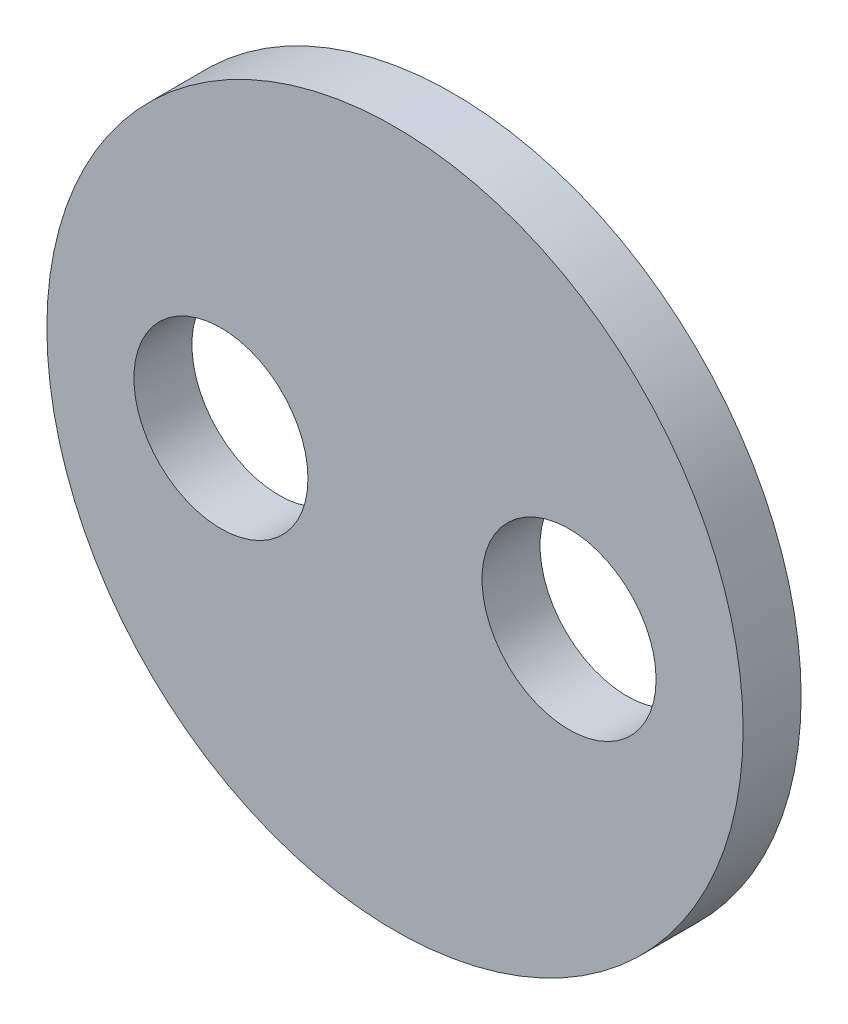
from build123d import *

# Parameters (mm, degrees)
SKETCH_1_R          = 6
EXTRUDE_1_DEPTH     = 1
SKETCH_2_R          = 1.5
CUT_EXTRUDE_1_DEPTH = 2


with BuildPart() as part:
    # Sketch 1 → Extrude 1 (new body)
    with BuildSketch(Plane.XY):
        Circle(SKETCH_1_R)
    extrude(amount=EXTRUDE_1_DEPTH)

    # Sketch 2 → Cut-Extrude 1 (cut)
    with BuildSketch(Plane.XY.offset(1)):
        with Locations((-3, 0)):
            Circle(SKETCH_2_R)
        with Locations((3, 0)):
            Circle(SKETCH_2_R)
    extrude(amount=-CUT_EXTRUDE_1_DEPTH, mode=Mode.SUBTRACT)


solid = part.part
